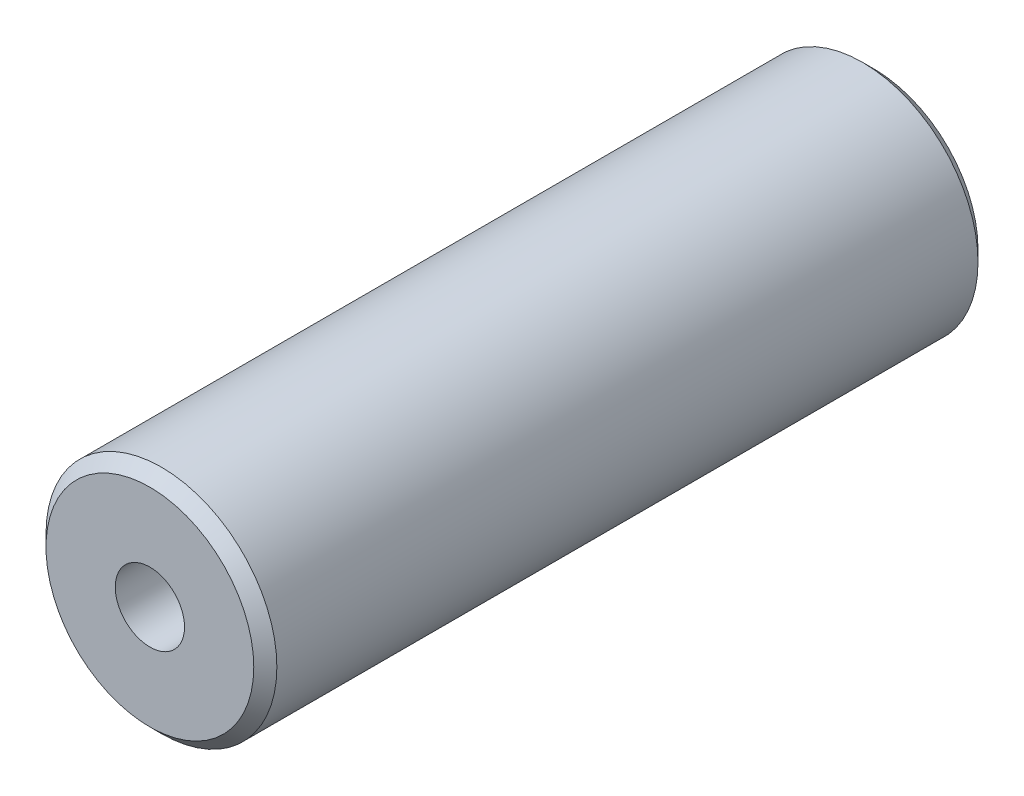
from build123d import *

# Parameters (mm, degrees)
SKETCH_1_R          = 10
EXTRUDE_1_DEPTH     = 62.74
CHAMFER_1_SIZE      = 1
SKETCH_2_R          = 3
CUT_EXTRUDE_1_DEPTH = 10
CUT_EXTRUDE_START   = -10
SKETCH_3_R          = 3
CUT_EXTRUDE_2_DEPTH = 10


with BuildPart() as part:
    # Sketch 1 → Extrude 1 (new body)
    with BuildSketch(Plane.XY):
        Circle(SKETCH_1_R)
    extrude(amount=EXTRUDE_1_DEPTH)

    # Chamfer 1
    chamfer_1_edges = [part.edges().sort_by_distance(p)[0] for p in [
        (-10, 0, 0),
        (-10, 0, 62.74),
    ]]
    chamfer(chamfer_1_edges, length=CHAMFER_1_SIZE)

    # Sketch 2 → Cut-Extrude 1 (cut)
    with BuildSketch(Plane.XY.offset(62.74)):
        Circle(SKETCH_2_R)
    extrude(amount=-CUT_EXTRUDE_1_DEPTH, mode=Mode.SUBTRACT)

    # Sketch 3 → Cut-Extrude 2 (cut)
    with BuildSketch(Plane(origin=(0, 0, 0), x_dir=(-1, 0, 0), z_dir=(0, 0, -1)).offset(CUT_EXTRUDE_START)):
        with Locations(Location((0, 0, 0), (0, 0, 180))):
            Circle(SKETCH_3_R)
    extrude(amount=CUT_EXTRUDE_2_DEPTH, mode=Mode.SUBTRACT)


solid = part.part
